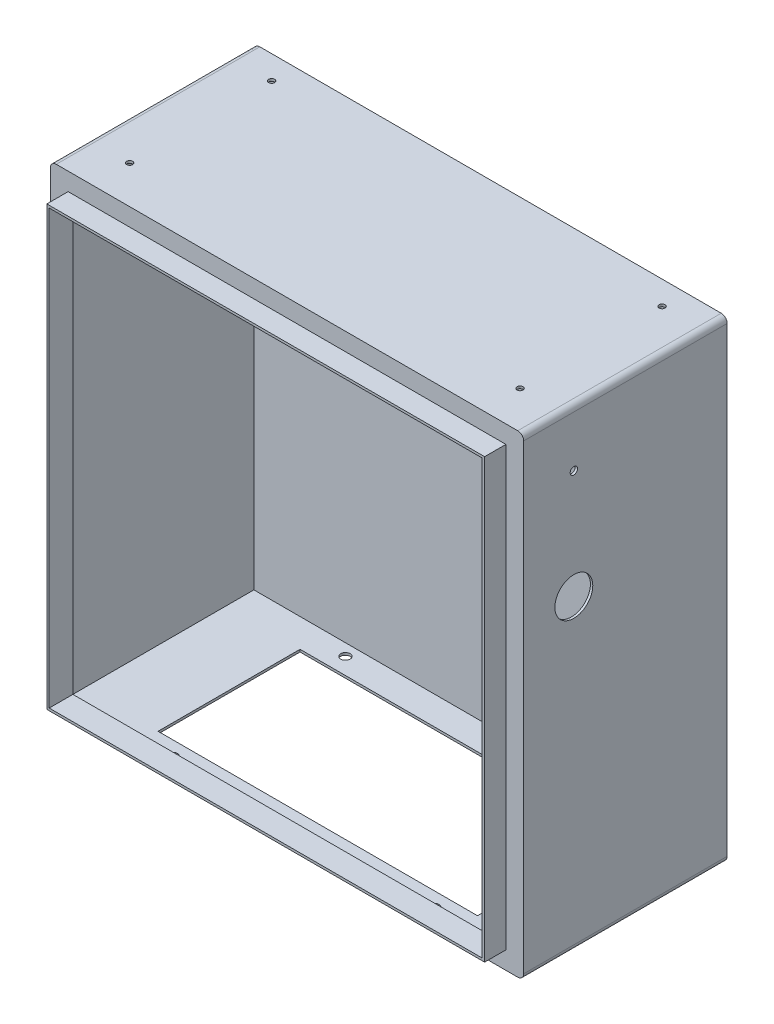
from build123d import *

# Parameters (mm, degrees)
ESQUISSE1_W             = 400
ESQUISSE1_H             = 400
BOSS_EXTRU_1_DEPTH      = 170
COQUE1_T                = -2
ESQUISSE2_W             = 400
ESQUISSE2_H             = 400
ESQUISSE2_W_2           = 370
ESQUISSE2_H_2           = 370
BOSS_EXTRU_2_DEPTH      = 2
BOSS_EXTRU_3_DEPTH      = 18
BOSS_EXTRU_3_DEPTH_BACK = 2
ESQUISSE3_W             = 370
ESQUISSE3_H             = 370
ESQUISSE3_W_2           = 366
ESQUISSE3_H_2           = 366
CONG_1_R                = 5
ESQUISSE5_W             = 270
ESQUISSE5_H             = 120
ENL_V_MAT_EXTRU_2_DEPTH = 5
ESQUISSE6_R             = 2.5
ENL_V_MAT_EXTRU_3_DEPTH = 10
ESQUISSE7_R             = 4
ENL_V_MAT_EXTRU_4_DEPTH = 5
ESQUISSE8_R             = 16
ENL_V_MAT_EXTRU_5_DEPTH = 10
ESQUISSE9_R             = 3.1
ENL_V_MAT_EXTRU_6_DEPTH = 10


with BuildPart() as part:
    # Esquisse1 → Boss.-Extru.1 (new body)
    with BuildSketch(Plane.XY):
        with Locations((200, 200)):
            Rectangle(ESQUISSE1_W, ESQUISSE1_H)
    extrude(amount=BOSS_EXTRU_1_DEPTH)

    # Coque1
    coque1_openings = [part.faces().sort_by_distance(p)[0] for p in [
        (200, 200, 170),
    ]]
    offset(amount=COQUE1_T, openings=coque1_openings, kind=Kind.INTERSECTION)

    # Esquisse2 → Boss.-Extru.2 (add)
    with BuildSketch(Plane.XY.offset(170)):
        with Locations((200, 200)):
            Rectangle(ESQUISSE2_W, ESQUISSE2_H)
        with Locations((200, 200)):
            Rectangle(ESQUISSE2_W_2, ESQUISSE2_H_2, mode=Mode.SUBTRACT)
    extrude(amount=BOSS_EXTRU_2_DEPTH)

    # Esquisse3 → Boss.-Extru.3 (add, two sides: drawn at the far end of the back side and taken through both)
    with BuildSketch(Plane.XY.offset(172).offset(-BOSS_EXTRU_3_DEPTH_BACK)):
        with Locations((200, 200)):
            Rectangle(ESQUISSE3_W, ESQUISSE3_H)
        with Locations((200, 200)):
            Rectangle(ESQUISSE3_W_2, ESQUISSE3_H_2, mode=Mode.SUBTRACT)
    extrude(amount=BOSS_EXTRU_3_DEPTH + BOSS_EXTRU_3_DEPTH_BACK)

    # Cong_1
    cong_1_edges = [part.edges().sort_by_distance(p)[0] for p in [
        (0, 400, 86),
        (400, 400, 86),
        (400, 0, 86),
        (0, 0, 86),
    ]]
    fillet(cong_1_edges, radius=CONG_1_R)

    # Esquisse5 → Enl_v. mat.-Extru.2 (cut)
    with BuildSketch(Plane.XZ):
        with Locations((200, 86)):
            Rectangle(ESQUISSE5_W, ESQUISSE5_H)
    extrude(amount=-ENL_V_MAT_EXTRU_2_DEPTH, mode=Mode.SUBTRACT)

    # Esquisse6 → Enl_v. mat.-Extru.3 (cut)
    with BuildSketch(Plane(origin=(0, 400, 0), x_dir=(1, 0, 0), z_dir=(0, 1, 0))):
        with Locations(Location((35, -20, 0), (0, 0, 270))):
            Circle(ESQUISSE6_R)
        with Locations(Location((365, -140, 0), (0, 0, 270))):
            Circle(ESQUISSE6_R)
        with Locations(Location((365, -20, 0), (0, 0, 270))):
            Circle(ESQUISSE6_R)
        with Locations(Location((35, -140, 0), (0, 0, 270))):
            Circle(ESQUISSE6_R)
    extrude(amount=-ENL_V_MAT_EXTRU_3_DEPTH, mode=Mode.SUBTRACT)

    # Esquisse7 → Enl_v. mat.-Extru.4 (cut)
    with BuildSketch(Plane.XZ):
        with Locations(Location((310.63, 12, 0), (0, 0, 270))):
            Circle(ESQUISSE7_R)
        with Locations(Location((89.37, 12, 0), (0, 0, 270))):
            Circle(ESQUISSE7_R)
        with Locations(Location((89.37, 158, 0), (0, 0, 270))):
            Circle(ESQUISSE7_R)
        with Locations(Location((310.63, 158, 0), (0, 0, 270))):
            Circle(ESQUISSE7_R)
    extrude(amount=-ENL_V_MAT_EXTRU_4_DEPTH, mode=Mode.SUBTRACT)

    # Esquisse8 → Enl_v. mat.-Extru.5 (cut)
    with BuildSketch(Plane(origin=(400, 0, 0), x_dir=(0, 0, -1), z_dir=(1, 0, 0))):
        with Locations((-129.589298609, 260)):
            Circle(ESQUISSE8_R)
    extrude(amount=-ENL_V_MAT_EXTRU_5_DEPTH, mode=Mode.SUBTRACT)

    # Esquisse9 → Enl_v. mat.-Extru.6 (cut)
    with BuildSketch(Plane(origin=(400, 0, 0), x_dir=(0, 0, -1), z_dir=(1, 0, 0))):
        with Locations((-129.589298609, 352)):
            Circle(ESQUISSE9_R)
    extrude(amount=-ENL_V_MAT_EXTRU_6_DEPTH, mode=Mode.SUBTRACT)


solid = part.part
